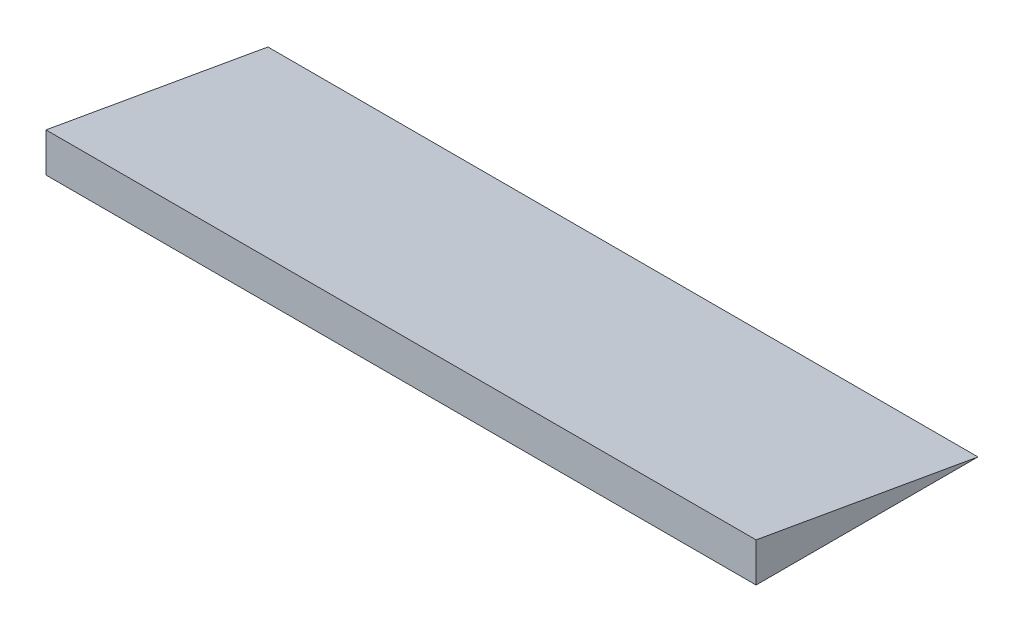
from build123d import *

# Parameters (mm, degrees)
BOSS_EXTRU_1_DEPTH      = 1600
ESQUISSE2_R             = 5
ENL_V_MAT_EXTRU_1_DEPTH = 10


with BuildPart() as part:
    # Esquisse1 → Boss.-Extru.1 (new body)
    with BuildSketch(Plane(origin=(0, 0, 0), x_dir=(0, 0, -1), z_dir=(1, 0, 0))):
        Polygon((0, 0), (500, 0), (0, 88.163490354), align=None)
    extrude(amount=BOSS_EXTRU_1_DEPTH)

    # Esquisse2 → Enl_v. mat.-Extru.1 (cut)
    with BuildSketch(Plane.XZ):
        with Locations(Location((550, -250, 0), (0, 0, 270))):
            Circle(ESQUISSE2_R)
        with Locations(Location((1050, -250, 0), (0, 0, 90))):
            Circle(ESQUISSE2_R)
    extrude(amount=-ENL_V_MAT_EXTRU_1_DEPTH, mode=Mode.SUBTRACT)


solid = part.part
